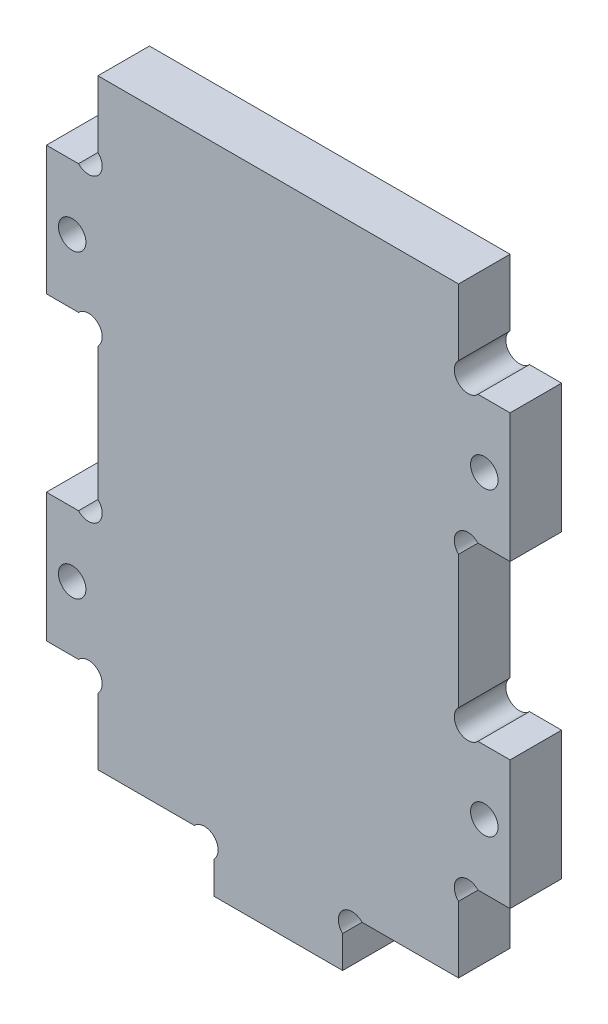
from build123d import *

# Parameters (mm, degrees)
ESQUISSE1_R      = 1.6
EXTRUSION1_DEPTH = 6


with BuildPart() as part:
    # Esquisse1 → Extrusion1 (new body)
    with BuildSketch(Plane.XY):
        with BuildLine():
            Line((-21, 70), (21, 70))
            Line((21, 70), (21, 62.261895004))
            ThreePointArc((21, 62.261895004), (20.96862915, 59.96862915), (23.261895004, 60))
            Line((23.261895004, 60), (27, 60))
            Line((27, 60), (27, 45))
            Line((27, 45), (23.261895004, 45))
            ThreePointArc((23.261895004, 45), (20.96862915, 45.03137085), (21, 42.738104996))
            Line((21, 42.738104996), (21, 27.261895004))
            ThreePointArc((21, 27.261895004), (20.96862915, 24.96862915), (23.261895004, 25))
            Line((23.261895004, 25), (27, 25))
            Line((27, 25), (27, 10))
            Line((27, 10), (23.261895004, 10))
            ThreePointArc((23.261895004, 10), (20.96862915, 10.03137085), (21, 7.738104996))
            Line((21, 7.738104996), (21, 0))
            Line((21, 0), (9.761895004, 0))
            ThreePointArc((9.761895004, 0), (7.46862915, 0.03137085), (7.5, -2.261895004))
            Line((7.5, -2.261895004), (7.5, -6))
            Line((7.5, -6), (-7.5, -6))
            Line((-7.5, -6), (-7.5, -2.261895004))
            ThreePointArc((-7.5, -2.261895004), (-7.46862915, 0.03137085), (-9.761895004, 0))
            Line((-9.761895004, 0), (-21, 0))
            Line((-21, 0), (-21, 7.738104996))
            ThreePointArc((-21, 7.738104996), (-20.96862915, 10.03137085), (-23.261895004, 10))
            Line((-23.261895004, 10), (-27, 10))
            Line((-27, 10), (-27, 25))
            Line((-27, 25), (-23.261895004, 25))
            ThreePointArc((-23.261895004, 25), (-20.96862915, 24.96862915), (-21, 27.261895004))
            Line((-21, 27.261895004), (-21, 42.738104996))
            ThreePointArc((-21, 42.738104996), (-20.96862915, 45.03137085), (-23.261895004, 45))
            Line((-23.261895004, 45), (-27, 45))
            Line((-27, 45), (-27, 60))
            Line((-27, 60), (-23.261895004, 60))
            ThreePointArc((-23.261895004, 60), (-20.96862915, 59.96862915), (-21, 62.261895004))
            Line((-21, 62.261895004), (-21, 70))
        make_face()
        with Locations((24, 52.5)):
            Circle(ESQUISSE1_R, mode=Mode.SUBTRACT)
        with Locations((24, 17.5)):
            Circle(ESQUISSE1_R, mode=Mode.SUBTRACT)
        with Locations(Location((-24, 52.5, 0), (0, 0, 180))):
            Circle(ESQUISSE1_R, mode=Mode.SUBTRACT)
        with Locations(Location((-24, 17.5, 0), (0, 0, 180))):
            Circle(ESQUISSE1_R, mode=Mode.SUBTRACT)
    extrude(amount=EXTRUSION1_DEPTH)


solid = part.part
